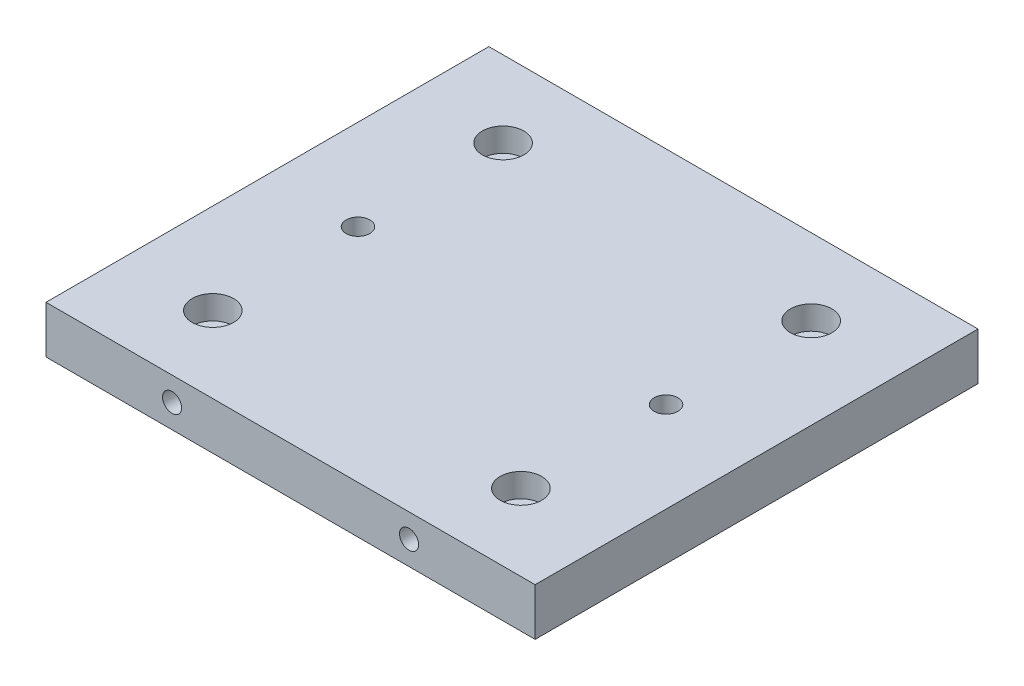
ISO-10303-21;
HEADER;
FILE_DESCRIPTION(('STEP AP214'),'2;1');
FILE_NAME('part.step','',(''),(''),'','','');
FILE_SCHEMA(('AUTOMOTIVE_DESIGN { 1 0 10303 214 1 1 1 1 }'));
ENDSEC;
DATA;
#1=APPLICATION_CONTEXT('core data for automotive mechanical design processes');
#2=APPLICATION_PROTOCOL_DEFINITION('international standard','automotive_design',2000,#1);
#3=PRODUCT_CONTEXT('',#1,'mechanical');
#4=PRODUCT('Part','Part','',(#3));
#5=PRODUCT_RELATED_PRODUCT_CATEGORY('part','',(#4));
#6=PRODUCT_DEFINITION_FORMATION('','',#4);
#7=PRODUCT_DEFINITION_CONTEXT('part definition',#1,'design');
#8=PRODUCT_DEFINITION('design','',#6,#7);
#9=PRODUCT_DEFINITION_SHAPE('','',#8);
#10=(LENGTH_UNIT() NAMED_UNIT(*) SI_UNIT(.MILLI.,.METRE.));
#11=(NAMED_UNIT(*) PLANE_ANGLE_UNIT() SI_UNIT($,.RADIAN.));
#12=(NAMED_UNIT(*) SI_UNIT($,.STERADIAN.) SOLID_ANGLE_UNIT());
#13=UNCERTAINTY_MEASURE_WITH_UNIT(LENGTH_MEASURE(1.E-05),#10,'distance_accuracy_value','');
#14=(GEOMETRIC_REPRESENTATION_CONTEXT(3) GLOBAL_UNCERTAINTY_ASSIGNED_CONTEXT((#13)) GLOBAL_UNIT_ASSIGNED_CONTEXT((#10,
#11,#12)) REPRESENTATION_CONTEXT('',''));
#15=CARTESIAN_POINT('',(0.,0.,0.));
#16=DIRECTION('',(0.,0.,1.));
#17=DIRECTION('',(1.,0.,0.));
#18=AXIS2_PLACEMENT_3D('',#15,#16,#17);
#19=CARTESIAN_POINT('',(65.532,12.7,-59.3344));
#20=DIRECTION('',(-1.,0.,0.));
#21=DIRECTION('',(0.,0.,1.));
#22=AXIS2_PLACEMENT_3D('',#19,#20,#21);
#23=PLANE('',#22);
#24=DIRECTION('',(0.,0.,-1.));
#25=VECTOR('',#24,1.);
#26=CARTESIAN_POINT('',(65.532,0.,-59.3344));
#27=LINE('',#26,#25);
#28=CARTESIAN_POINT('',(65.532,0.,59.3344));
#29=VERTEX_POINT('',#28);
#30=CARTESIAN_POINT('',(65.532,0.,-59.3344));
#31=VERTEX_POINT('',#30);
#32=EDGE_CURVE('E192',#29,#31,#27,.T.);
#33=ORIENTED_EDGE('',*,*,#32,.T.);
#34=DIRECTION('',(0.,-1.,0.));
#35=VECTOR('',#34,1.);
#36=CARTESIAN_POINT('',(65.532,12.7,-59.3344));
#37=LINE('',#36,#35);
#38=CARTESIAN_POINT('',(65.532,12.7,-59.3344));
#39=VERTEX_POINT('',#38);
#40=EDGE_CURVE('E11',#39,#31,#37,.T.);
#41=ORIENTED_EDGE('',*,*,#40,.F.);
#42=DIRECTION('',(0.,0.,-1.));
#43=VECTOR('',#42,1.);
#44=CARTESIAN_POINT('',(65.532,12.7,-59.3344));
#45=LINE('',#44,#43);
#46=CARTESIAN_POINT('',(65.532,12.7,59.3344));
#47=VERTEX_POINT('',#46);
#48=EDGE_CURVE('E193',#47,#39,#45,.T.);
#49=ORIENTED_EDGE('',*,*,#48,.F.);
#50=DIRECTION('',(0.,-1.,0.));
#51=VECTOR('',#50,1.);
#52=CARTESIAN_POINT('',(65.532,12.7,59.3344));
#53=LINE('',#52,#51);
#54=EDGE_CURVE('E199',#47,#29,#53,.T.);
#55=ORIENTED_EDGE('',*,*,#54,.T.);
#56=EDGE_LOOP('',(#33,#41,#49,#55));
#57=FACE_BOUND('',#56,.T.);
#58=ADVANCED_FACE('F39',(#57),#23,.F.);
#59=CARTESIAN_POINT('',(-65.532,12.7,-59.3344));
#60=DIRECTION('',(0.,0.,1.));
#61=DIRECTION('',(1.,0.,0.));
#62=AXIS2_PLACEMENT_3D('',#59,#60,#61);
#63=PLANE('',#62);
#64=CARTESIAN_POINT('',(-31.75,6.35,-59.3344));
#65=DIRECTION('',(0.,0.,-1.));
#66=DIRECTION('',(-1.,0.,0.));
#67=AXIS2_PLACEMENT_3D('',#64,#65,#66);
#68=CIRCLE('',#67,2.55269999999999);
#69=CARTESIAN_POINT('',(-34.3027,6.35,-59.3344));
#70=VERTEX_POINT('',#69);
#71=EDGE_CURVE('E120',#70,#70,#68,.T.);
#72=ORIENTED_EDGE('',*,*,#71,.F.);
#73=EDGE_LOOP('',(#72));
#74=FACE_BOUND('',#73,.T.);
#75=CARTESIAN_POINT('',(31.75,6.35,-59.3344));
#76=DIRECTION('',(0.,0.,-1.));
#77=DIRECTION('',(-1.,0.,0.));
#78=AXIS2_PLACEMENT_3D('',#75,#76,#77);
#79=CIRCLE('',#78,2.55269999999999);
#80=CARTESIAN_POINT('',(29.1973,6.35,-59.3344));
#81=VERTEX_POINT('',#80);
#82=EDGE_CURVE('E126',#81,#81,#79,.T.);
#83=ORIENTED_EDGE('',*,*,#82,.F.);
#84=EDGE_LOOP('',(#83));
#85=FACE_BOUND('',#84,.T.);
#86=DIRECTION('',(-1.,0.,0.));
#87=VECTOR('',#86,1.);
#88=CARTESIAN_POINT('',(-65.532,0.,-59.3344));
#89=LINE('',#88,#87);
#90=CARTESIAN_POINT('',(-65.532,0.,-59.3344));
#91=VERTEX_POINT('',#90);
#92=EDGE_CURVE('E202',#31,#91,#89,.T.);
#93=ORIENTED_EDGE('',*,*,#92,.T.);
#94=DIRECTION('',(0.,-1.,0.));
#95=VECTOR('',#94,1.);
#96=CARTESIAN_POINT('',(-65.532,12.7,-59.3344));
#97=LINE('',#96,#95);
#98=CARTESIAN_POINT('',(-65.532,12.7,-59.3344));
#99=VERTEX_POINT('',#98);
#100=EDGE_CURVE('E47',#99,#91,#97,.T.);
#101=ORIENTED_EDGE('',*,*,#100,.F.);
#102=DIRECTION('',(-1.,0.,0.));
#103=VECTOR('',#102,1.);
#104=CARTESIAN_POINT('',(-65.532,12.7,-59.3344));
#105=LINE('',#104,#103);
#106=EDGE_CURVE('E86',#39,#99,#105,.T.);
#107=ORIENTED_EDGE('',*,*,#106,.F.);
#108=ORIENTED_EDGE('',*,*,#40,.T.);
#109=EDGE_LOOP('',(#93,#101,#107,#108));
#110=FACE_BOUND('',#109,.T.);
#111=ADVANCED_FACE('F227',(#74,#85,#110),#63,.F.);
#112=CARTESIAN_POINT('',(-65.532,12.7,-59.3344));
#113=DIRECTION('',(1.,0.,0.));
#114=DIRECTION('',(0.,0.,-1.));
#115=AXIS2_PLACEMENT_3D('',#112,#113,#114);
#116=PLANE('',#115);
#117=DIRECTION('',(0.,0.,1.));
#118=VECTOR('',#117,1.);
#119=CARTESIAN_POINT('',(-65.532,0.,-59.3344));
#120=LINE('',#119,#118);
#121=CARTESIAN_POINT('',(-65.532,0.,59.3344));
#122=VERTEX_POINT('',#121);
#123=EDGE_CURVE('E73',#91,#122,#120,.T.);
#124=ORIENTED_EDGE('',*,*,#123,.T.);
#125=DIRECTION('',(0.,-1.,0.));
#126=VECTOR('',#125,1.);
#127=CARTESIAN_POINT('',(-65.532,12.7,59.3344));
#128=LINE('',#127,#126);
#129=CARTESIAN_POINT('',(-65.532,12.7,59.3344));
#130=VERTEX_POINT('',#129);
#131=EDGE_CURVE('E207',#130,#122,#128,.T.);
#132=ORIENTED_EDGE('',*,*,#131,.F.);
#133=DIRECTION('',(0.,0.,1.));
#134=VECTOR('',#133,1.);
#135=CARTESIAN_POINT('',(-65.532,12.7,-59.3344));
#136=LINE('',#135,#134);
#137=EDGE_CURVE('E196',#99,#130,#136,.T.);
#138=ORIENTED_EDGE('',*,*,#137,.F.);
#139=ORIENTED_EDGE('',*,*,#100,.T.);
#140=EDGE_LOOP('',(#124,#132,#138,#139));
#141=FACE_BOUND('',#140,.T.);
#142=ADVANCED_FACE('F209',(#141),#116,.F.);
#143=CARTESIAN_POINT('',(-65.532,12.7,59.3344));
#144=DIRECTION('',(0.,0.,-1.));
#145=DIRECTION('',(-1.,0.,0.));
#146=AXIS2_PLACEMENT_3D('',#143,#144,#145);
#147=PLANE('',#146);
#148=CARTESIAN_POINT('',(-31.75,6.35,59.3344));
#149=DIRECTION('',(0.,0.,1.));
#150=DIRECTION('',(1.,0.,0.));
#151=AXIS2_PLACEMENT_3D('',#148,#149,#150);
#152=CIRCLE('',#151,2.55269999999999);
#153=CARTESIAN_POINT('',(-29.1973,6.35,59.3344));
#154=VERTEX_POINT('',#153);
#155=EDGE_CURVE('E110',#154,#154,#152,.T.);
#156=ORIENTED_EDGE('',*,*,#155,.F.);
#157=EDGE_LOOP('',(#156));
#158=FACE_BOUND('',#157,.T.);
#159=CARTESIAN_POINT('',(31.75,6.35,59.3344));
#160=DIRECTION('',(0.,0.,1.));
#161=DIRECTION('',(1.,0.,0.));
#162=AXIS2_PLACEMENT_3D('',#159,#160,#161);
#163=CIRCLE('',#162,2.55269999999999);
#164=CARTESIAN_POINT('',(34.3027,6.35,59.3344));
#165=VERTEX_POINT('',#164);
#166=EDGE_CURVE('E109',#165,#165,#163,.T.);
#167=ORIENTED_EDGE('',*,*,#166,.F.);
#168=EDGE_LOOP('',(#167));
#169=FACE_BOUND('',#168,.T.);
#170=DIRECTION('',(1.,0.,0.));
#171=VECTOR('',#170,1.);
#172=CARTESIAN_POINT('',(-65.532,0.,59.3344));
#173=LINE('',#172,#171);
#174=EDGE_CURVE('E79',#122,#29,#173,.T.);
#175=ORIENTED_EDGE('',*,*,#174,.T.);
#176=ORIENTED_EDGE('',*,*,#54,.F.);
#177=DIRECTION('',(1.,0.,0.));
#178=VECTOR('',#177,1.);
#179=CARTESIAN_POINT('',(-65.532,12.7,59.3344));
#180=LINE('',#179,#178);
#181=EDGE_CURVE('E55',#130,#47,#180,.T.);
#182=ORIENTED_EDGE('',*,*,#181,.F.);
#183=ORIENTED_EDGE('',*,*,#131,.T.);
#184=EDGE_LOOP('',(#175,#176,#182,#183));
#185=FACE_BOUND('',#184,.T.);
#186=ADVANCED_FACE('F216',(#158,#169,#185),#147,.F.);
#187=CARTESIAN_POINT('',(0.,12.7,0.));
#188=DIRECTION('',(0.,1.,0.));
#189=DIRECTION('',(0.,0.,1.));
#190=AXIS2_PLACEMENT_3D('',#187,#188,#189);
#191=PLANE('',#190);
#192=CARTESIAN_POINT('',(41.2749999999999,12.7,0.));
#193=DIRECTION('',(0.,-1.,0.));
#194=DIRECTION('',(0.,0.,-1.));
#195=AXIS2_PLACEMENT_3D('',#192,#193,#194);
#196=CIRCLE('',#195,3.175);
#197=CARTESIAN_POINT('',(41.2749999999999,12.7,-3.17499999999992));
#198=VERTEX_POINT('',#197);
#199=EDGE_CURVE('E135',#198,#198,#196,.T.);
#200=ORIENTED_EDGE('',*,*,#199,.T.);
#201=EDGE_LOOP('',(#200));
#202=FACE_BOUND('',#201,.T.);
#203=CARTESIAN_POINT('',(-41.2750000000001,12.7,1.17961196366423E-13));
#204=DIRECTION('',(0.,-1.,0.));
#205=DIRECTION('',(0.,0.,-1.));
#206=AXIS2_PLACEMENT_3D('',#203,#204,#205);
#207=CIRCLE('',#206,3.175);
#208=CARTESIAN_POINT('',(-41.2750000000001,12.7,-3.17499999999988));
#209=VERTEX_POINT('',#208);
#210=EDGE_CURVE('E141',#209,#209,#207,.T.);
#211=ORIENTED_EDGE('',*,*,#210,.T.);
#212=EDGE_LOOP('',(#211));
#213=FACE_BOUND('',#212,.T.);
#214=CARTESIAN_POINT('',(41.2749999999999,12.7,38.8874000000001));
#215=DIRECTION('',(0.,1.,0.));
#216=DIRECTION('',(0.,0.,1.));
#217=AXIS2_PLACEMENT_3D('',#214,#215,#216);
#218=CIRCLE('',#217,5.55625);
#219=CARTESIAN_POINT('',(41.2749999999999,12.7,44.4436500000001));
#220=VERTEX_POINT('',#219);
#221=EDGE_CURVE('E144',#220,#220,#218,.T.);
#222=ORIENTED_EDGE('',*,*,#221,.F.);
#223=EDGE_LOOP('',(#222));
#224=FACE_BOUND('',#223,.T.);
#225=CARTESIAN_POINT('',(41.2749999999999,12.7,-38.8873999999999));
#226=DIRECTION('',(0.,1.,0.));
#227=DIRECTION('',(0.,0.,1.));
#228=AXIS2_PLACEMENT_3D('',#225,#226,#227);
#229=CIRCLE('',#228,5.55625);
#230=CARTESIAN_POINT('',(41.2749999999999,12.7,-33.3311499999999));
#231=VERTEX_POINT('',#230);
#232=EDGE_CURVE('E156',#231,#231,#229,.T.);
#233=ORIENTED_EDGE('',*,*,#232,.F.);
#234=EDGE_LOOP('',(#233));
#235=FACE_BOUND('',#234,.T.);
#236=CARTESIAN_POINT('',(-41.2750000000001,12.7,38.8874000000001));
#237=DIRECTION('',(0.,1.,0.));
#238=DIRECTION('',(0.,0.,1.));
#239=AXIS2_PLACEMENT_3D('',#236,#237,#238);
#240=CIRCLE('',#239,5.55625);
#241=CARTESIAN_POINT('',(-41.2750000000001,12.7,44.4436500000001));
#242=VERTEX_POINT('',#241);
#243=EDGE_CURVE('E168',#242,#242,#240,.T.);
#244=ORIENTED_EDGE('',*,*,#243,.F.);
#245=EDGE_LOOP('',(#244));
#246=FACE_BOUND('',#245,.T.);
#247=CARTESIAN_POINT('',(-41.2750000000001,12.7,-38.8873999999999));
#248=DIRECTION('',(0.,1.,0.));
#249=DIRECTION('',(0.,0.,1.));
#250=AXIS2_PLACEMENT_3D('',#247,#248,#249);
#251=CIRCLE('',#250,5.55625);
#252=CARTESIAN_POINT('',(-41.2750000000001,12.7,-33.3311499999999));
#253=VERTEX_POINT('',#252);
#254=EDGE_CURVE('E180',#253,#253,#251,.T.);
#255=ORIENTED_EDGE('',*,*,#254,.F.);
#256=EDGE_LOOP('',(#255));
#257=FACE_BOUND('',#256,.T.);
#258=ORIENTED_EDGE('',*,*,#48,.T.);
#259=ORIENTED_EDGE('',*,*,#106,.T.);
#260=ORIENTED_EDGE('',*,*,#137,.T.);
#261=ORIENTED_EDGE('',*,*,#181,.T.);
#262=EDGE_LOOP('',(#258,#259,#260,#261));
#263=FACE_BOUND('',#262,.T.);
#264=ADVANCED_FACE('F218',(#202,#213,#224,#235,#246,#257,#263),#191,.T.);
#265=CARTESIAN_POINT('',(0.,0.,0.));
#266=DIRECTION('',(0.,1.,0.));
#267=DIRECTION('',(0.,0.,1.));
#268=AXIS2_PLACEMENT_3D('',#265,#266,#267);
#269=PLANE('',#268);
#270=CARTESIAN_POINT('',(41.2749999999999,0.,0.));
#271=DIRECTION('',(0.,-1.,0.));
#272=DIRECTION('',(0.,0.,-1.));
#273=AXIS2_PLACEMENT_3D('',#270,#271,#272);
#274=CIRCLE('',#273,3.175);
#275=CARTESIAN_POINT('',(41.2749999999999,0.,-3.17499999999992));
#276=VERTEX_POINT('',#275);
#277=EDGE_CURVE('E132',#276,#276,#274,.T.);
#278=ORIENTED_EDGE('',*,*,#277,.F.);
#279=EDGE_LOOP('',(#278));
#280=FACE_BOUND('',#279,.T.);
#281=CARTESIAN_POINT('',(-41.2750000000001,0.,1.17961196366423E-13));
#282=DIRECTION('',(0.,-1.,0.));
#283=DIRECTION('',(0.,0.,-1.));
#284=AXIS2_PLACEMENT_3D('',#281,#282,#283);
#285=CIRCLE('',#284,3.175);
#286=CARTESIAN_POINT('',(-41.2750000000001,0.,-3.17499999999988));
#287=VERTEX_POINT('',#286);
#288=EDGE_CURVE('E138',#287,#287,#285,.T.);
#289=ORIENTED_EDGE('',*,*,#288,.F.);
#290=EDGE_LOOP('',(#289));
#291=FACE_BOUND('',#290,.T.);
#292=CARTESIAN_POINT('',(41.2749999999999,0.,38.8874000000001));
#293=DIRECTION('',(0.,1.,0.));
#294=DIRECTION('',(0.,0.,1.));
#295=AXIS2_PLACEMENT_3D('',#292,#293,#294);
#296=CIRCLE('',#295,3.3782);
#297=CARTESIAN_POINT('',(41.2749999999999,0.,42.2656000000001));
#298=VERTEX_POINT('',#297);
#299=EDGE_CURVE('E153',#298,#298,#296,.T.);
#300=ORIENTED_EDGE('',*,*,#299,.T.);
#301=EDGE_LOOP('',(#300));
#302=FACE_BOUND('',#301,.T.);
#303=CARTESIAN_POINT('',(41.2749999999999,0.,-38.8873999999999));
#304=DIRECTION('',(0.,1.,0.));
#305=DIRECTION('',(0.,0.,1.));
#306=AXIS2_PLACEMENT_3D('',#303,#304,#305);
#307=CIRCLE('',#306,3.3782);
#308=CARTESIAN_POINT('',(41.2749999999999,0.,-35.5091999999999));
#309=VERTEX_POINT('',#308);
#310=EDGE_CURVE('E165',#309,#309,#307,.T.);
#311=ORIENTED_EDGE('',*,*,#310,.T.);
#312=EDGE_LOOP('',(#311));
#313=FACE_BOUND('',#312,.T.);
#314=CARTESIAN_POINT('',(-41.2750000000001,0.,38.8874000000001));
#315=DIRECTION('',(0.,1.,0.));
#316=DIRECTION('',(0.,0.,1.));
#317=AXIS2_PLACEMENT_3D('',#314,#315,#316);
#318=CIRCLE('',#317,3.3782);
#319=CARTESIAN_POINT('',(-41.2750000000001,0.,42.2656000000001));
#320=VERTEX_POINT('',#319);
#321=EDGE_CURVE('E177',#320,#320,#318,.T.);
#322=ORIENTED_EDGE('',*,*,#321,.T.);
#323=EDGE_LOOP('',(#322));
#324=FACE_BOUND('',#323,.T.);
#325=CARTESIAN_POINT('',(-41.2750000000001,0.,-38.8873999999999));
#326=DIRECTION('',(0.,1.,0.));
#327=DIRECTION('',(0.,0.,1.));
#328=AXIS2_PLACEMENT_3D('',#325,#326,#327);
#329=CIRCLE('',#328,3.3782);
#330=CARTESIAN_POINT('',(-41.2750000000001,0.,-35.5091999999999));
#331=VERTEX_POINT('',#330);
#332=EDGE_CURVE('E189',#331,#331,#329,.T.);
#333=ORIENTED_EDGE('',*,*,#332,.T.);
#334=EDGE_LOOP('',(#333));
#335=FACE_BOUND('',#334,.T.);
#336=ORIENTED_EDGE('',*,*,#32,.F.);
#337=ORIENTED_EDGE('',*,*,#174,.F.);
#338=ORIENTED_EDGE('',*,*,#123,.F.);
#339=ORIENTED_EDGE('',*,*,#92,.F.);
#340=EDGE_LOOP('',(#336,#337,#338,#339));
#341=FACE_BOUND('',#340,.T.);
#342=ADVANCED_FACE('F212',(#280,#291,#302,#313,#324,#335,#341),#269,.F.);
#343=CARTESIAN_POINT('',(-41.2750000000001,12.7,-38.8873999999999));
#344=DIRECTION('',(0.,1.,0.));
#345=DIRECTION('',(0.,0.,1.));
#346=AXIS2_PLACEMENT_3D('',#343,#344,#345);
#347=CYLINDRICAL_SURFACE('',#346,3.3782);
#348=ORIENTED_EDGE('',*,*,#332,.F.);
#349=EDGE_LOOP('',(#348));
#350=FACE_BOUND('',#349,.T.);
#351=CARTESIAN_POINT('',(-41.2750000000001,6.35,-38.8873999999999));
#352=DIRECTION('',(0.,1.,0.));
#353=DIRECTION('',(0.,0.,1.));
#354=AXIS2_PLACEMENT_3D('',#351,#352,#353);
#355=CIRCLE('',#354,3.3782);
#356=CARTESIAN_POINT('',(-41.2750000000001,6.35,-35.5091999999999));
#357=VERTEX_POINT('',#356);
#358=EDGE_CURVE('E186',#357,#357,#355,.T.);
#359=ORIENTED_EDGE('',*,*,#358,.T.);
#360=EDGE_LOOP('',(#359));
#361=FACE_BOUND('',#360,.T.);
#362=ADVANCED_FACE('F312',(#350,#361),#347,.F.);
#363=CARTESIAN_POINT('',(-37.8968000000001,6.35,-38.8873999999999));
#364=DIRECTION('',(0.,-1.,0.));
#365=DIRECTION('',(0.,0.,-1.));
#366=AXIS2_PLACEMENT_3D('',#363,#364,#365);
#367=PLANE('',#366);
#368=ORIENTED_EDGE('',*,*,#358,.F.);
#369=EDGE_LOOP('',(#368));
#370=FACE_BOUND('',#369,.T.);
#371=CARTESIAN_POINT('',(-41.2750000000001,6.35,-38.8873999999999));
#372=DIRECTION('',(0.,1.,0.));
#373=DIRECTION('',(0.,0.,1.));
#374=AXIS2_PLACEMENT_3D('',#371,#372,#373);
#375=CIRCLE('',#374,5.55625);
#376=CARTESIAN_POINT('',(-41.2750000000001,6.35,-33.3311499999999));
#377=VERTEX_POINT('',#376);
#378=EDGE_CURVE('E183',#377,#377,#375,.T.);
#379=ORIENTED_EDGE('',*,*,#378,.T.);
#380=EDGE_LOOP('',(#379));
#381=FACE_BOUND('',#380,.T.);
#382=ADVANCED_FACE('F308',(#370,#381),#367,.F.);
#383=CARTESIAN_POINT('',(-41.2750000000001,12.7,-38.8873999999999));
#384=DIRECTION('',(0.,1.,0.));
#385=DIRECTION('',(0.,0.,1.));
#386=AXIS2_PLACEMENT_3D('',#383,#384,#385);
#387=CYLINDRICAL_SURFACE('',#386,5.55625);
#388=ORIENTED_EDGE('',*,*,#378,.F.);
#389=EDGE_LOOP('',(#388));
#390=FACE_BOUND('',#389,.T.);
#391=ORIENTED_EDGE('',*,*,#254,.T.);
#392=EDGE_LOOP('',(#391));
#393=FACE_BOUND('',#392,.T.);
#394=ADVANCED_FACE('F304',(#390,#393),#387,.F.);
#395=CARTESIAN_POINT('',(-41.2750000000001,12.7,38.8874000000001));
#396=DIRECTION('',(0.,1.,0.));
#397=DIRECTION('',(0.,0.,1.));
#398=AXIS2_PLACEMENT_3D('',#395,#396,#397);
#399=CYLINDRICAL_SURFACE('',#398,3.3782);
#400=ORIENTED_EDGE('',*,*,#321,.F.);
#401=EDGE_LOOP('',(#400));
#402=FACE_BOUND('',#401,.T.);
#403=CARTESIAN_POINT('',(-41.2750000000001,6.35,38.8874000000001));
#404=DIRECTION('',(0.,1.,0.));
#405=DIRECTION('',(0.,0.,1.));
#406=AXIS2_PLACEMENT_3D('',#403,#404,#405);
#407=CIRCLE('',#406,3.3782);
#408=CARTESIAN_POINT('',(-41.2750000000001,6.35,42.2656000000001));
#409=VERTEX_POINT('',#408);
#410=EDGE_CURVE('E174',#409,#409,#407,.T.);
#411=ORIENTED_EDGE('',*,*,#410,.T.);
#412=EDGE_LOOP('',(#411));
#413=FACE_BOUND('',#412,.T.);
#414=ADVANCED_FACE('F300',(#402,#413),#399,.F.);
#415=CARTESIAN_POINT('',(-37.8968000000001,6.35,38.8874000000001));
#416=DIRECTION('',(0.,-1.,0.));
#417=DIRECTION('',(0.,0.,-1.));
#418=AXIS2_PLACEMENT_3D('',#415,#416,#417);
#419=PLANE('',#418);
#420=ORIENTED_EDGE('',*,*,#410,.F.);
#421=EDGE_LOOP('',(#420));
#422=FACE_BOUND('',#421,.T.);
#423=CARTESIAN_POINT('',(-41.2750000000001,6.35,38.8874000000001));
#424=DIRECTION('',(0.,1.,0.));
#425=DIRECTION('',(0.,0.,1.));
#426=AXIS2_PLACEMENT_3D('',#423,#424,#425);
#427=CIRCLE('',#426,5.55625);
#428=CARTESIAN_POINT('',(-41.2750000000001,6.35,44.4436500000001));
#429=VERTEX_POINT('',#428);
#430=EDGE_CURVE('E171',#429,#429,#427,.T.);
#431=ORIENTED_EDGE('',*,*,#430,.T.);
#432=EDGE_LOOP('',(#431));
#433=FACE_BOUND('',#432,.T.);
#434=ADVANCED_FACE('F296',(#422,#433),#419,.F.);
#435=CARTESIAN_POINT('',(-41.2750000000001,12.7,38.8874000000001));
#436=DIRECTION('',(0.,1.,0.));
#437=DIRECTION('',(0.,0.,1.));
#438=AXIS2_PLACEMENT_3D('',#435,#436,#437);
#439=CYLINDRICAL_SURFACE('',#438,5.55625);
#440=ORIENTED_EDGE('',*,*,#430,.F.);
#441=EDGE_LOOP('',(#440));
#442=FACE_BOUND('',#441,.T.);
#443=ORIENTED_EDGE('',*,*,#243,.T.);
#444=EDGE_LOOP('',(#443));
#445=FACE_BOUND('',#444,.T.);
#446=ADVANCED_FACE('F292',(#442,#445),#439,.F.);
#447=CARTESIAN_POINT('',(41.2749999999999,12.7,-38.8873999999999));
#448=DIRECTION('',(0.,1.,0.));
#449=DIRECTION('',(0.,0.,1.));
#450=AXIS2_PLACEMENT_3D('',#447,#448,#449);
#451=CYLINDRICAL_SURFACE('',#450,3.3782);
#452=ORIENTED_EDGE('',*,*,#310,.F.);
#453=EDGE_LOOP('',(#452));
#454=FACE_BOUND('',#453,.T.);
#455=CARTESIAN_POINT('',(41.2749999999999,6.35,-38.8873999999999));
#456=DIRECTION('',(0.,1.,0.));
#457=DIRECTION('',(0.,0.,1.));
#458=AXIS2_PLACEMENT_3D('',#455,#456,#457);
#459=CIRCLE('',#458,3.3782);
#460=CARTESIAN_POINT('',(41.2749999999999,6.35,-35.5091999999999));
#461=VERTEX_POINT('',#460);
#462=EDGE_CURVE('E162',#461,#461,#459,.T.);
#463=ORIENTED_EDGE('',*,*,#462,.T.);
#464=EDGE_LOOP('',(#463));
#465=FACE_BOUND('',#464,.T.);
#466=ADVANCED_FACE('F288',(#454,#465),#451,.F.);
#467=CARTESIAN_POINT('',(44.6531999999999,6.35,-38.8873999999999));
#468=DIRECTION('',(0.,-1.,0.));
#469=DIRECTION('',(0.,0.,-1.));
#470=AXIS2_PLACEMENT_3D('',#467,#468,#469);
#471=PLANE('',#470);
#472=ORIENTED_EDGE('',*,*,#462,.F.);
#473=EDGE_LOOP('',(#472));
#474=FACE_BOUND('',#473,.T.);
#475=CARTESIAN_POINT('',(41.2749999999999,6.35,-38.8873999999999));
#476=DIRECTION('',(0.,1.,0.));
#477=DIRECTION('',(0.,0.,1.));
#478=AXIS2_PLACEMENT_3D('',#475,#476,#477);
#479=CIRCLE('',#478,5.55625);
#480=CARTESIAN_POINT('',(41.2749999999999,6.35,-33.3311499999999));
#481=VERTEX_POINT('',#480);
#482=EDGE_CURVE('E159',#481,#481,#479,.T.);
#483=ORIENTED_EDGE('',*,*,#482,.T.);
#484=EDGE_LOOP('',(#483));
#485=FACE_BOUND('',#484,.T.);
#486=ADVANCED_FACE('F284',(#474,#485),#471,.F.);
#487=CARTESIAN_POINT('',(41.2749999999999,12.7,-38.8873999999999));
#488=DIRECTION('',(0.,1.,0.));
#489=DIRECTION('',(0.,0.,1.));
#490=AXIS2_PLACEMENT_3D('',#487,#488,#489);
#491=CYLINDRICAL_SURFACE('',#490,5.55625);
#492=ORIENTED_EDGE('',*,*,#482,.F.);
#493=EDGE_LOOP('',(#492));
#494=FACE_BOUND('',#493,.T.);
#495=ORIENTED_EDGE('',*,*,#232,.T.);
#496=EDGE_LOOP('',(#495));
#497=FACE_BOUND('',#496,.T.);
#498=ADVANCED_FACE('F280',(#494,#497),#491,.F.);
#499=CARTESIAN_POINT('',(41.2749999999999,12.7,38.8874000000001));
#500=DIRECTION('',(0.,1.,0.));
#501=DIRECTION('',(0.,0.,1.));
#502=AXIS2_PLACEMENT_3D('',#499,#500,#501);
#503=CYLINDRICAL_SURFACE('',#502,3.3782);
#504=ORIENTED_EDGE('',*,*,#299,.F.);
#505=EDGE_LOOP('',(#504));
#506=FACE_BOUND('',#505,.T.);
#507=CARTESIAN_POINT('',(41.2749999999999,6.35,38.8874000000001));
#508=DIRECTION('',(0.,1.,0.));
#509=DIRECTION('',(0.,0.,1.));
#510=AXIS2_PLACEMENT_3D('',#507,#508,#509);
#511=CIRCLE('',#510,3.3782);
#512=CARTESIAN_POINT('',(41.2749999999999,6.35,42.2656000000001));
#513=VERTEX_POINT('',#512);
#514=EDGE_CURVE('E150',#513,#513,#511,.T.);
#515=ORIENTED_EDGE('',*,*,#514,.T.);
#516=EDGE_LOOP('',(#515));
#517=FACE_BOUND('',#516,.T.);
#518=ADVANCED_FACE('F276',(#506,#517),#503,.F.);
#519=CARTESIAN_POINT('',(44.6531999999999,6.35,38.8874000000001));
#520=DIRECTION('',(0.,-1.,0.));
#521=DIRECTION('',(0.,0.,-1.));
#522=AXIS2_PLACEMENT_3D('',#519,#520,#521);
#523=PLANE('',#522);
#524=ORIENTED_EDGE('',*,*,#514,.F.);
#525=EDGE_LOOP('',(#524));
#526=FACE_BOUND('',#525,.T.);
#527=CARTESIAN_POINT('',(41.2749999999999,6.35,38.8874000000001));
#528=DIRECTION('',(0.,1.,0.));
#529=DIRECTION('',(0.,0.,1.));
#530=AXIS2_PLACEMENT_3D('',#527,#528,#529);
#531=CIRCLE('',#530,5.55625);
#532=CARTESIAN_POINT('',(41.2749999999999,6.35,44.4436500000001));
#533=VERTEX_POINT('',#532);
#534=EDGE_CURVE('E147',#533,#533,#531,.T.);
#535=ORIENTED_EDGE('',*,*,#534,.T.);
#536=EDGE_LOOP('',(#535));
#537=FACE_BOUND('',#536,.T.);
#538=ADVANCED_FACE('F272',(#526,#537),#523,.F.);
#539=CARTESIAN_POINT('',(41.2749999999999,12.7,38.8874000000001));
#540=DIRECTION('',(0.,1.,0.));
#541=DIRECTION('',(0.,0.,1.));
#542=AXIS2_PLACEMENT_3D('',#539,#540,#541);
#543=CYLINDRICAL_SURFACE('',#542,5.55625);
#544=ORIENTED_EDGE('',*,*,#534,.F.);
#545=EDGE_LOOP('',(#544));
#546=FACE_BOUND('',#545,.T.);
#547=ORIENTED_EDGE('',*,*,#221,.T.);
#548=EDGE_LOOP('',(#547));
#549=FACE_BOUND('',#548,.T.);
#550=ADVANCED_FACE('F268',(#546,#549),#543,.F.);
#551=CARTESIAN_POINT('',(-41.2750000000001,0.,1.17961196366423E-13));
#552=DIRECTION('',(0.,-1.,0.));
#553=DIRECTION('',(0.,0.,-1.));
#554=AXIS2_PLACEMENT_3D('',#551,#552,#553);
#555=CYLINDRICAL_SURFACE('',#554,3.175);
#556=ORIENTED_EDGE('',*,*,#210,.F.);
#557=EDGE_LOOP('',(#556));
#558=FACE_BOUND('',#557,.T.);
#559=ORIENTED_EDGE('',*,*,#288,.T.);
#560=EDGE_LOOP('',(#559));
#561=FACE_BOUND('',#560,.T.);
#562=ADVANCED_FACE('F264',(#558,#561),#555,.F.);
#563=CARTESIAN_POINT('',(41.2749999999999,0.,0.));
#564=DIRECTION('',(0.,-1.,0.));
#565=DIRECTION('',(0.,0.,-1.));
#566=AXIS2_PLACEMENT_3D('',#563,#564,#565);
#567=CYLINDRICAL_SURFACE('',#566,3.175);
#568=ORIENTED_EDGE('',*,*,#199,.F.);
#569=EDGE_LOOP('',(#568));
#570=FACE_BOUND('',#569,.T.);
#571=ORIENTED_EDGE('',*,*,#277,.T.);
#572=EDGE_LOOP('',(#571));
#573=FACE_BOUND('',#572,.T.);
#574=ADVANCED_FACE('F256',(#570,#573),#567,.F.);
#575=CARTESIAN_POINT('',(31.75,6.35,-42.8244));
#576=DIRECTION('',(0.,0.,-1.));
#577=DIRECTION('',(-1.,0.,0.));
#578=AXIS2_PLACEMENT_3D('',#575,#576,#577);
#579=CONICAL_SURFACE('',#578,2.55269999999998,1.02974425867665);
#580=CARTESIAN_POINT('',(31.75,6.35,-41.2905830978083));
#581=VERTEX_POINT('',#580);
#582=VERTEX_LOOP('',#581);
#583=FACE_BOUND('',#582,.T.);
#584=CARTESIAN_POINT('',(31.75,6.35,-42.8244));
#585=DIRECTION('',(0.,0.,-1.));
#586=DIRECTION('',(-1.,0.,0.));
#587=AXIS2_PLACEMENT_3D('',#584,#585,#586);
#588=CIRCLE('',#587,2.55269999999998);
#589=CARTESIAN_POINT('',(29.1973,6.35,-42.8244));
#590=VERTEX_POINT('',#589);
#591=EDGE_CURVE('E129',#590,#590,#588,.T.);
#592=ORIENTED_EDGE('',*,*,#591,.T.);
#593=EDGE_LOOP('',(#592));
#594=FACE_BOUND('',#593,.T.);
#595=ADVANCED_FACE('F246',(#583,#594),#579,.F.);
#596=CARTESIAN_POINT('',(31.75,6.35,-59.3344));
#597=DIRECTION('',(0.,0.,-1.));
#598=DIRECTION('',(-1.,0.,0.));
#599=AXIS2_PLACEMENT_3D('',#596,#597,#598);
#600=CYLINDRICAL_SURFACE('',#599,2.55269999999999);
#601=ORIENTED_EDGE('',*,*,#591,.F.);
#602=EDGE_LOOP('',(#601));
#603=FACE_BOUND('',#602,.T.);
#604=ORIENTED_EDGE('',*,*,#82,.T.);
#605=EDGE_LOOP('',(#604));
#606=FACE_BOUND('',#605,.T.);
#607=ADVANCED_FACE('F243',(#603,#606),#600,.F.);
#608=CARTESIAN_POINT('',(-31.75,6.35,-42.8244));
#609=DIRECTION('',(0.,0.,-1.));
#610=DIRECTION('',(-1.,0.,0.));
#611=AXIS2_PLACEMENT_3D('',#608,#609,#610);
#612=CONICAL_SURFACE('',#611,2.55269999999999,1.02974425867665);
#613=CARTESIAN_POINT('',(-31.75,6.35,-41.2905830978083));
#614=VERTEX_POINT('',#613);
#615=VERTEX_LOOP('',#614);
#616=FACE_BOUND('',#615,.T.);
#617=CARTESIAN_POINT('',(-31.75,6.35,-42.8244));
#618=DIRECTION('',(0.,0.,-1.));
#619=DIRECTION('',(-1.,0.,0.));
#620=AXIS2_PLACEMENT_3D('',#617,#618,#619);
#621=CIRCLE('',#620,2.55269999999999);
#622=CARTESIAN_POINT('',(-34.3027,6.35,-42.8244));
#623=VERTEX_POINT('',#622);
#624=EDGE_CURVE('E123',#623,#623,#621,.T.);
#625=ORIENTED_EDGE('',*,*,#624,.T.);
#626=EDGE_LOOP('',(#625));
#627=FACE_BOUND('',#626,.T.);
#628=ADVANCED_FACE('F245',(#616,#627),#612,.F.);
#629=CARTESIAN_POINT('',(-31.75,6.35,-59.3344));
#630=DIRECTION('',(0.,0.,-1.));
#631=DIRECTION('',(-1.,0.,0.));
#632=AXIS2_PLACEMENT_3D('',#629,#630,#631);
#633=CYLINDRICAL_SURFACE('',#632,2.55269999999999);
#634=ORIENTED_EDGE('',*,*,#624,.F.);
#635=EDGE_LOOP('',(#634));
#636=FACE_BOUND('',#635,.T.);
#637=ORIENTED_EDGE('',*,*,#71,.T.);
#638=EDGE_LOOP('',(#637));
#639=FACE_BOUND('',#638,.T.);
#640=ADVANCED_FACE('F253',(#636,#639),#633,.F.);
#641=CARTESIAN_POINT('',(31.75,6.35,42.8244));
#642=DIRECTION('',(0.,0.,1.));
#643=DIRECTION('',(1.,0.,0.));
#644=AXIS2_PLACEMENT_3D('',#641,#642,#643);
#645=CONICAL_SURFACE('',#644,2.55269999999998,1.02974425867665);
#646=CARTESIAN_POINT('',(31.75,6.35,41.2905830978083));
#647=VERTEX_POINT('',#646);
#648=VERTEX_LOOP('',#647);
#649=FACE_BOUND('',#648,.T.);
#650=CARTESIAN_POINT('',(31.75,6.35,42.8244));
#651=DIRECTION('',(0.,0.,1.));
#652=DIRECTION('',(1.,0.,0.));
#653=AXIS2_PLACEMENT_3D('',#650,#651,#652);
#654=CIRCLE('',#653,2.55269999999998);
#655=CARTESIAN_POINT('',(34.3027,6.35,42.8244));
#656=VERTEX_POINT('',#655);
#657=EDGE_CURVE('E113',#656,#656,#654,.T.);
#658=ORIENTED_EDGE('',*,*,#657,.T.);
#659=EDGE_LOOP('',(#658));
#660=FACE_BOUND('',#659,.T.);
#661=ADVANCED_FACE('F449',(#649,#660),#645,.F.);
#662=CARTESIAN_POINT('',(31.75,6.35,59.3344));
#663=DIRECTION('',(0.,0.,1.));
#664=DIRECTION('',(1.,0.,0.));
#665=AXIS2_PLACEMENT_3D('',#662,#663,#664);
#666=CYLINDRICAL_SURFACE('',#665,2.55269999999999);
#667=ORIENTED_EDGE('',*,*,#657,.F.);
#668=EDGE_LOOP('',(#667));
#669=FACE_BOUND('',#668,.T.);
#670=ORIENTED_EDGE('',*,*,#166,.T.);
#671=EDGE_LOOP('',(#670));
#672=FACE_BOUND('',#671,.T.);
#673=ADVANCED_FACE('F103',(#669,#672),#666,.F.);
#674=CARTESIAN_POINT('',(-31.75,6.35,42.8244));
#675=DIRECTION('',(0.,0.,1.));
#676=DIRECTION('',(1.,0.,0.));
#677=AXIS2_PLACEMENT_3D('',#674,#675,#676);
#678=CONICAL_SURFACE('',#677,2.55269999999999,1.02974425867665);
#679=CARTESIAN_POINT('',(-31.75,6.35,41.2905830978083));
#680=VERTEX_POINT('',#679);
#681=VERTEX_LOOP('',#680);
#682=FACE_BOUND('',#681,.T.);
#683=CARTESIAN_POINT('',(-31.75,6.35,42.8244));
#684=DIRECTION('',(0.,0.,1.));
#685=DIRECTION('',(1.,0.,0.));
#686=AXIS2_PLACEMENT_3D('',#683,#684,#685);
#687=CIRCLE('',#686,2.55269999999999);
#688=CARTESIAN_POINT('',(-29.1973,6.35,42.8244));
#689=VERTEX_POINT('',#688);
#690=EDGE_CURVE('E107',#689,#689,#687,.T.);
#691=ORIENTED_EDGE('',*,*,#690,.T.);
#692=EDGE_LOOP('',(#691));
#693=FACE_BOUND('',#692,.T.);
#694=ADVANCED_FACE('F99',(#682,#693),#678,.F.);
#695=CARTESIAN_POINT('',(-31.75,6.35,59.3344));
#696=DIRECTION('',(0.,0.,1.));
#697=DIRECTION('',(1.,0.,0.));
#698=AXIS2_PLACEMENT_3D('',#695,#696,#697);
#699=CYLINDRICAL_SURFACE('',#698,2.55269999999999);
#700=ORIENTED_EDGE('',*,*,#690,.F.);
#701=EDGE_LOOP('',(#700));
#702=FACE_BOUND('',#701,.T.);
#703=ORIENTED_EDGE('',*,*,#155,.T.);
#704=EDGE_LOOP('',(#703));
#705=FACE_BOUND('',#704,.T.);
#706=ADVANCED_FACE('F102',(#702,#705),#699,.F.);
#707=CLOSED_SHELL('',(#58,#111,#142,#186,#264,#342,#362,#382,#394,#414,#434,#446,#466,#486,#498,
#518,#538,#550,#562,#574,#595,#607,#628,#640,#661,#673,#694,#706));
#708=MANIFOLD_SOLID_BREP('B2',#707);
#709=ADVANCED_BREP_SHAPE_REPRESENTATION('',(#18,#708),#14);
#710=SHAPE_DEFINITION_REPRESENTATION(#9,#709);
ENDSEC;
END-ISO-10303-21;
